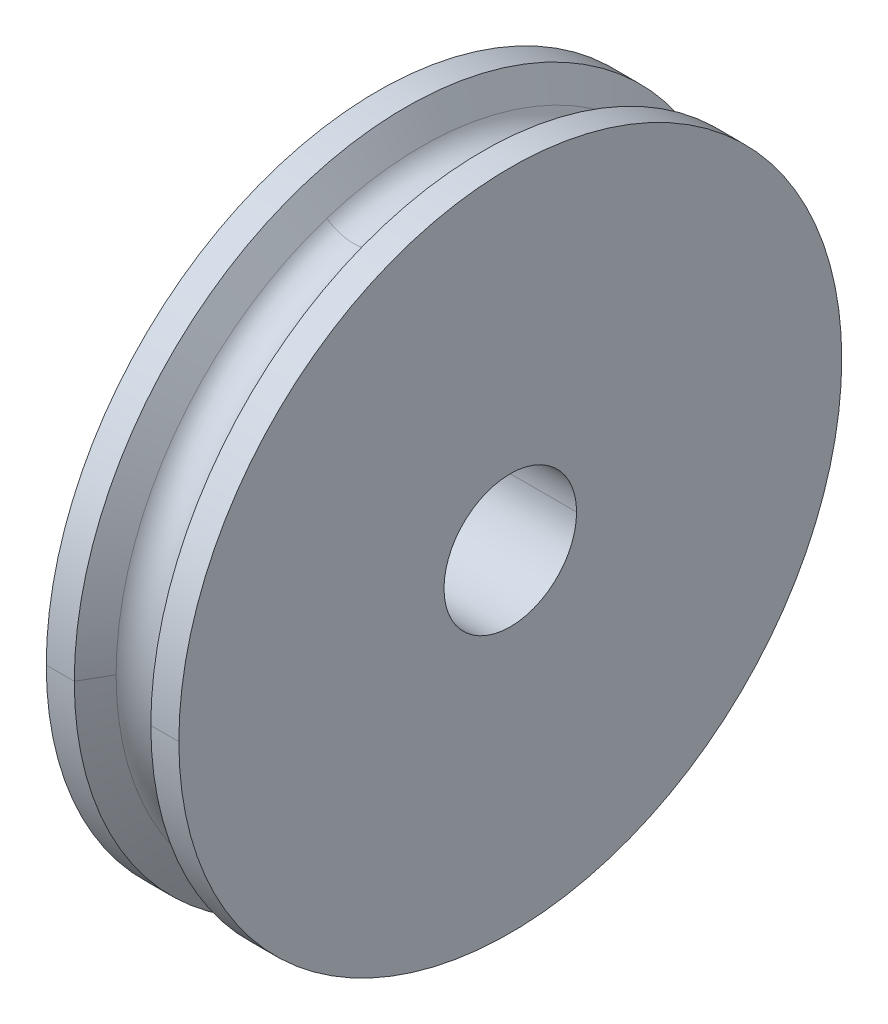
ISO-10303-21;
HEADER;
FILE_DESCRIPTION(('STEP AP214'),'2;1');
FILE_NAME('part.step','',(''),(''),'','','');
FILE_SCHEMA(('AUTOMOTIVE_DESIGN { 1 0 10303 214 1 1 1 1 }'));
ENDSEC;
DATA;
#1=APPLICATION_CONTEXT('core data for automotive mechanical design processes');
#2=APPLICATION_PROTOCOL_DEFINITION('international standard','automotive_design',2000,#1);
#3=PRODUCT_CONTEXT('',#1,'mechanical');
#4=PRODUCT('Part','Part','',(#3));
#5=PRODUCT_RELATED_PRODUCT_CATEGORY('part','',(#4));
#6=PRODUCT_DEFINITION_FORMATION('','',#4);
#7=PRODUCT_DEFINITION_CONTEXT('part definition',#1,'design');
#8=PRODUCT_DEFINITION('design','',#6,#7);
#9=PRODUCT_DEFINITION_SHAPE('','',#8);
#10=(LENGTH_UNIT() NAMED_UNIT(*) SI_UNIT(.MILLI.,.METRE.));
#11=(NAMED_UNIT(*) PLANE_ANGLE_UNIT() SI_UNIT($,.RADIAN.));
#12=(NAMED_UNIT(*) SI_UNIT($,.STERADIAN.) SOLID_ANGLE_UNIT());
#13=UNCERTAINTY_MEASURE_WITH_UNIT(LENGTH_MEASURE(1.E-05),#10,'distance_accuracy_value','');
#14=(GEOMETRIC_REPRESENTATION_CONTEXT(3) GLOBAL_UNCERTAINTY_ASSIGNED_CONTEXT((#13)) GLOBAL_UNIT_ASSIGNED_CONTEXT((#10,
#11,#12)) REPRESENTATION_CONTEXT('',''));
#15=CARTESIAN_POINT('',(0.,0.,0.));
#16=DIRECTION('',(0.,0.,1.));
#17=DIRECTION('',(1.,0.,0.));
#18=AXIS2_PLACEMENT_3D('',#15,#16,#17);
#19=CARTESIAN_POINT('',(-5.,25.,0.));
#20=DIRECTION('',(-1.,0.,0.));
#21=DIRECTION('',(0.,0.,1.));
#22=AXIS2_PLACEMENT_3D('',#19,#20,#21);
#23=PLANE('',#22);
#24=CARTESIAN_POINT('',(-5.,0.,0.));
#25=DIRECTION('',(1.,0.,0.));
#26=DIRECTION('',(0.,0.,-1.));
#27=AXIS2_PLACEMENT_3D('',#24,#25,#26);
#28=CIRCLE('',#27,5.);
#29=CARTESIAN_POINT('',(-5.,0.,-5.));
#30=VERTEX_POINT('',#29);
#31=CARTESIAN_POINT('',(-5.,0.,5.));
#32=VERTEX_POINT('',#31);
#33=EDGE_CURVE('E11',#30,#32,#28,.T.);
#34=ORIENTED_EDGE('',*,*,#33,.T.);
#35=CARTESIAN_POINT('',(-5.,0.,0.));
#36=DIRECTION('',(1.,0.,0.));
#37=DIRECTION('',(0.,0.,-1.));
#38=AXIS2_PLACEMENT_3D('',#35,#36,#37);
#39=CIRCLE('',#38,5.);
#40=EDGE_CURVE('E25',#32,#30,#39,.T.);
#41=ORIENTED_EDGE('',*,*,#40,.T.);
#42=EDGE_LOOP('',(#34,#41));
#43=FACE_BOUND('',#42,.T.);
#44=CARTESIAN_POINT('',(-5.,0.,0.));
#45=DIRECTION('',(1.,0.,0.));
#46=DIRECTION('',(0.,0.,-1.));
#47=AXIS2_PLACEMENT_3D('',#44,#45,#46);
#48=CIRCLE('',#47,25.);
#49=CARTESIAN_POINT('',(-5.,0.,25.));
#50=VERTEX_POINT('',#49);
#51=CARTESIAN_POINT('',(-5.,0.,-25.));
#52=VERTEX_POINT('',#51);
#53=EDGE_CURVE('E219',#50,#52,#48,.T.);
#54=ORIENTED_EDGE('',*,*,#53,.F.);
#55=CARTESIAN_POINT('',(-5.,0.,0.));
#56=DIRECTION('',(1.,0.,0.));
#57=DIRECTION('',(0.,0.,-1.));
#58=AXIS2_PLACEMENT_3D('',#55,#56,#57);
#59=CIRCLE('',#58,25.);
#60=EDGE_CURVE('E214',#52,#50,#59,.T.);
#61=ORIENTED_EDGE('',*,*,#60,.F.);
#62=EDGE_LOOP('',(#54,#61));
#63=FACE_BOUND('',#62,.T.);
#64=ADVANCED_FACE('F17',(#43,#63),#23,.T.);
#65=CARTESIAN_POINT('',(5.,0.,0.));
#66=DIRECTION('',(1.,0.,0.));
#67=DIRECTION('',(0.,-1.,-1.13303980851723E-13));
#68=AXIS2_PLACEMENT_3D('',#65,#66,#67);
#69=CYLINDRICAL_SURFACE('',#68,25.);
#70=DIRECTION('',(1.,0.,0.));
#71=VECTOR('',#70,1.);
#72=CARTESIAN_POINT('',(-5.,0.,25.));
#73=LINE('',#72,#71);
#74=CARTESIAN_POINT('',(-2.8867513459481,0.,25.));
#75=VERTEX_POINT('',#74);
#76=EDGE_CURVE('E210',#50,#75,#73,.T.);
#77=ORIENTED_EDGE('',*,*,#76,.T.);
#78=CARTESIAN_POINT('',(-2.8867513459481,0.,0.));
#79=DIRECTION('',(1.,0.,0.));
#80=DIRECTION('',(0.,0.,-1.));
#81=AXIS2_PLACEMENT_3D('',#78,#79,#80);
#82=CIRCLE('',#81,25.);
#83=CARTESIAN_POINT('',(-2.8867513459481,0.,-25.));
#84=VERTEX_POINT('',#83);
#85=EDGE_CURVE('E205',#84,#75,#82,.T.);
#86=ORIENTED_EDGE('',*,*,#85,.F.);
#87=DIRECTION('',(1.,0.,0.));
#88=VECTOR('',#87,1.);
#89=CARTESIAN_POINT('',(-5.,0.,-25.));
#90=LINE('',#89,#88);
#91=EDGE_CURVE('E200',#52,#84,#90,.T.);
#92=ORIENTED_EDGE('',*,*,#91,.F.);
#93=ORIENTED_EDGE('',*,*,#60,.T.);
#94=EDGE_LOOP('',(#77,#86,#92,#93));
#95=FACE_BOUND('',#94,.T.);
#96=ADVANCED_FACE('F235',(#95),#69,.T.);
#97=CARTESIAN_POINT('',(5.,0.,0.));
#98=DIRECTION('',(1.,0.,0.));
#99=DIRECTION('',(0.,1.,0.));
#100=AXIS2_PLACEMENT_3D('',#97,#98,#99);
#101=CYLINDRICAL_SURFACE('',#100,25.);
#102=ORIENTED_EDGE('',*,*,#76,.F.);
#103=ORIENTED_EDGE('',*,*,#53,.T.);
#104=ORIENTED_EDGE('',*,*,#91,.T.);
#105=CARTESIAN_POINT('',(-2.8867513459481,0.,0.));
#106=DIRECTION('',(1.,0.,0.));
#107=DIRECTION('',(0.,0.,-1.));
#108=AXIS2_PLACEMENT_3D('',#105,#106,#107);
#109=CIRCLE('',#108,25.);
#110=EDGE_CURVE('E195',#75,#84,#109,.T.);
#111=ORIENTED_EDGE('',*,*,#110,.F.);
#112=EDGE_LOOP('',(#102,#103,#104,#111));
#113=FACE_BOUND('',#112,.T.);
#114=ADVANCED_FACE('F230',(#113),#101,.T.);
#115=CARTESIAN_POINT('',(-1.7320508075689,0.,0.));
#116=DIRECTION('',(-1.,0.,0.));
#117=DIRECTION('',(0.,1.,0.));
#118=AXIS2_PLACEMENT_3D('',#115,#116,#117);
#119=CONICAL_SURFACE('',#118,23.,1.04719755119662);
#120=DIRECTION('',(-0.499999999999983,0.,-0.866025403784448));
#121=VECTOR('',#120,1.);
#122=CARTESIAN_POINT('',(-1.7320508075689,0.,-23.));
#123=LINE('',#122,#121);
#124=CARTESIAN_POINT('',(-1.7320508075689,0.,-23.));
#125=VERTEX_POINT('',#124);
#126=EDGE_CURVE('E190',#125,#84,#123,.T.);
#127=ORIENTED_EDGE('',*,*,#126,.F.);
#128=CARTESIAN_POINT('',(-1.7320508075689,0.,0.));
#129=DIRECTION('',(1.,0.,0.));
#130=DIRECTION('',(0.,0.,-1.));
#131=AXIS2_PLACEMENT_3D('',#128,#129,#130);
#132=CIRCLE('',#131,23.);
#133=CARTESIAN_POINT('',(-1.73205080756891,-21.8742998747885,-7.10739087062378));
#134=VERTEX_POINT('',#133);
#135=EDGE_CURVE('E185',#134,#125,#132,.T.);
#136=ORIENTED_EDGE('',*,*,#135,.F.);
#137=CARTESIAN_POINT('',(-1.7320508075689,0.,0.));
#138=DIRECTION('',(1.,0.,0.));
#139=DIRECTION('',(0.,0.,-1.));
#140=AXIS2_PLACEMENT_3D('',#137,#138,#139);
#141=CIRCLE('',#140,23.);
#142=CARTESIAN_POINT('',(-1.7320508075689,0.,23.));
#143=VERTEX_POINT('',#142);
#144=EDGE_CURVE('E180',#143,#134,#141,.T.);
#145=ORIENTED_EDGE('',*,*,#144,.F.);
#146=DIRECTION('',(-0.499999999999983,0.,0.866025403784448));
#147=VECTOR('',#146,1.);
#148=CARTESIAN_POINT('',(-1.7320508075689,0.,23.));
#149=LINE('',#148,#147);
#150=EDGE_CURVE('E175',#143,#75,#149,.T.);
#151=ORIENTED_EDGE('',*,*,#150,.T.);
#152=ORIENTED_EDGE('',*,*,#110,.T.);
#153=EDGE_LOOP('',(#127,#136,#145,#151,#152));
#154=FACE_BOUND('',#153,.T.);
#155=ADVANCED_FACE('F241',(#154),#119,.T.);
#156=CARTESIAN_POINT('',(-1.7320508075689,0.,0.));
#157=DIRECTION('',(-1.,0.,0.));
#158=DIRECTION('',(0.,-1.,0.));
#159=AXIS2_PLACEMENT_3D('',#156,#157,#158);
#160=CONICAL_SURFACE('',#159,23.,1.04719755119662);
#161=ORIENTED_EDGE('',*,*,#126,.T.);
#162=ORIENTED_EDGE('',*,*,#85,.T.);
#163=ORIENTED_EDGE('',*,*,#150,.F.);
#164=CARTESIAN_POINT('',(-1.7320508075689,0.,0.));
#165=DIRECTION('',(1.,0.,0.));
#166=DIRECTION('',(0.,0.,-1.));
#167=AXIS2_PLACEMENT_3D('',#164,#165,#166);
#168=CIRCLE('',#167,23.);
#169=CARTESIAN_POINT('',(-1.73205080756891,21.8742998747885,7.10739087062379));
#170=VERTEX_POINT('',#169);
#171=EDGE_CURVE('E170',#170,#143,#168,.T.);
#172=ORIENTED_EDGE('',*,*,#171,.F.);
#173=CARTESIAN_POINT('',(-1.7320508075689,0.,0.));
#174=DIRECTION('',(1.,0.,0.));
#175=DIRECTION('',(0.,0.,-1.));
#176=AXIS2_PLACEMENT_3D('',#173,#174,#175);
#177=CIRCLE('',#176,23.);
#178=EDGE_CURVE('E165',#125,#170,#177,.T.);
#179=ORIENTED_EDGE('',*,*,#178,.F.);
#180=EDGE_LOOP('',(#161,#162,#163,#172,#179));
#181=FACE_BOUND('',#180,.T.);
#182=ADVANCED_FACE('F238',(#181),#160,.T.);
#183=CARTESIAN_POINT('',(0.,0.,0.));
#184=DIRECTION('',(1.,0.,0.));
#185=DIRECTION('',(0.,-0.309016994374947,0.951056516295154));
#186=AXIS2_PLACEMENT_3D('',#183,#184,#185);
#187=TOROIDAL_SURFACE('',#186,24.,2.00000000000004);
#188=CARTESIAN_POINT('',(0.,-22.8253563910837,-7.41640786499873));
#189=DIRECTION('',(0.,0.309016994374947,-0.951056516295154));
#190=DIRECTION('',(-0.86602540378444,0.475528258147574,0.154508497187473));
#191=AXIS2_PLACEMENT_3D('',#188,#189,#190);
#192=CIRCLE('',#191,2.00000000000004);
#193=CARTESIAN_POINT('',(1.73205080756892,-21.8742998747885,-7.10739087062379));
#194=VERTEX_POINT('',#193);
#195=EDGE_CURVE('E160',#134,#194,#192,.T.);
#196=ORIENTED_EDGE('',*,*,#195,.F.);
#197=ORIENTED_EDGE('',*,*,#135,.T.);
#198=ORIENTED_EDGE('',*,*,#178,.T.);
#199=CARTESIAN_POINT('',(0.,22.8253563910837,7.41640786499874));
#200=DIRECTION('',(0.,-0.309016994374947,0.951056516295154));
#201=DIRECTION('',(-0.866025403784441,-0.475528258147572,-0.154508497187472));
#202=AXIS2_PLACEMENT_3D('',#199,#200,#201);
#203=CIRCLE('',#202,2.00000000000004);
#204=CARTESIAN_POINT('',(1.73205080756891,21.8742998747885,7.10739087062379));
#205=VERTEX_POINT('',#204);
#206=EDGE_CURVE('E156',#170,#205,#203,.T.);
#207=ORIENTED_EDGE('',*,*,#206,.T.);
#208=CARTESIAN_POINT('',(1.7320508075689,0.,0.));
#209=DIRECTION('',(1.,0.,0.));
#210=DIRECTION('',(0.,0.,-1.));
#211=AXIS2_PLACEMENT_3D('',#208,#209,#210);
#212=CIRCLE('',#211,23.);
#213=CARTESIAN_POINT('',(1.7320508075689,0.,-23.));
#214=VERTEX_POINT('',#213);
#215=EDGE_CURVE('E151',#214,#205,#212,.T.);
#216=ORIENTED_EDGE('',*,*,#215,.F.);
#217=CARTESIAN_POINT('',(1.7320508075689,0.,0.));
#218=DIRECTION('',(1.,0.,0.));
#219=DIRECTION('',(0.,0.,-1.));
#220=AXIS2_PLACEMENT_3D('',#217,#218,#219);
#221=CIRCLE('',#220,23.);
#222=EDGE_CURVE('E146',#194,#214,#221,.T.);
#223=ORIENTED_EDGE('',*,*,#222,.F.);
#224=EDGE_LOOP('',(#196,#197,#198,#207,#216,#223));
#225=FACE_BOUND('',#224,.T.);
#226=ADVANCED_FACE('F251',(#225),#187,.F.);
#227=CARTESIAN_POINT('',(2.8867513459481,0.,0.));
#228=DIRECTION('',(1.,0.,0.));
#229=DIRECTION('',(0.,1.,0.));
#230=AXIS2_PLACEMENT_3D('',#227,#228,#229);
#231=CONICAL_SURFACE('',#230,25.,1.04719755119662);
#232=DIRECTION('',(0.499999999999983,0.,0.866025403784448));
#233=VECTOR('',#232,1.);
#234=CARTESIAN_POINT('',(1.7320508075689,0.,23.));
#235=LINE('',#234,#233);
#236=CARTESIAN_POINT('',(1.7320508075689,0.,23.));
#237=VERTEX_POINT('',#236);
#238=CARTESIAN_POINT('',(2.8867513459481,0.,25.));
#239=VERTEX_POINT('',#238);
#240=EDGE_CURVE('E141',#237,#239,#235,.T.);
#241=ORIENTED_EDGE('',*,*,#240,.F.);
#242=CARTESIAN_POINT('',(1.7320508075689,0.,0.));
#243=DIRECTION('',(1.,0.,0.));
#244=DIRECTION('',(0.,0.,-1.));
#245=AXIS2_PLACEMENT_3D('',#242,#243,#244);
#246=CIRCLE('',#245,23.);
#247=EDGE_CURVE('E136',#237,#194,#246,.T.);
#248=ORIENTED_EDGE('',*,*,#247,.T.);
#249=ORIENTED_EDGE('',*,*,#222,.T.);
#250=DIRECTION('',(0.499999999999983,0.,-0.866025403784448));
#251=VECTOR('',#250,1.);
#252=CARTESIAN_POINT('',(1.7320508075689,0.,-23.));
#253=LINE('',#252,#251);
#254=CARTESIAN_POINT('',(2.8867513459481,0.,-25.));
#255=VERTEX_POINT('',#254);
#256=EDGE_CURVE('E132',#214,#255,#253,.T.);
#257=ORIENTED_EDGE('',*,*,#256,.T.);
#258=CARTESIAN_POINT('',(2.8867513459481,0.,0.));
#259=DIRECTION('',(1.,0.,0.));
#260=DIRECTION('',(0.,0.,-1.));
#261=AXIS2_PLACEMENT_3D('',#258,#259,#260);
#262=CIRCLE('',#261,25.);
#263=EDGE_CURVE('E127',#239,#255,#262,.T.);
#264=ORIENTED_EDGE('',*,*,#263,.F.);
#265=EDGE_LOOP('',(#241,#248,#249,#257,#264));
#266=FACE_BOUND('',#265,.T.);
#267=ADVANCED_FACE('F253',(#266),#231,.T.);
#268=CARTESIAN_POINT('',(5.,0.,0.));
#269=DIRECTION('',(1.,0.,0.));
#270=DIRECTION('',(0.,1.,0.));
#271=AXIS2_PLACEMENT_3D('',#268,#269,#270);
#272=CYLINDRICAL_SURFACE('',#271,25.);
#273=DIRECTION('',(1.,0.,0.));
#274=VECTOR('',#273,1.);
#275=CARTESIAN_POINT('',(2.8867513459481,0.,25.));
#276=LINE('',#275,#274);
#277=CARTESIAN_POINT('',(5.,0.,25.));
#278=VERTEX_POINT('',#277);
#279=EDGE_CURVE('E122',#239,#278,#276,.T.);
#280=ORIENTED_EDGE('',*,*,#279,.F.);
#281=ORIENTED_EDGE('',*,*,#263,.T.);
#282=DIRECTION('',(1.,0.,0.));
#283=VECTOR('',#282,1.);
#284=CARTESIAN_POINT('',(2.8867513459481,0.,-25.));
#285=LINE('',#284,#283);
#286=CARTESIAN_POINT('',(5.,0.,-25.));
#287=VERTEX_POINT('',#286);
#288=EDGE_CURVE('E118',#255,#287,#285,.T.);
#289=ORIENTED_EDGE('',*,*,#288,.T.);
#290=CARTESIAN_POINT('',(5.,0.,0.));
#291=DIRECTION('',(1.,0.,0.));
#292=DIRECTION('',(0.,0.,-1.));
#293=AXIS2_PLACEMENT_3D('',#290,#291,#292);
#294=CIRCLE('',#293,25.);
#295=EDGE_CURVE('E107',#278,#287,#294,.T.);
#296=ORIENTED_EDGE('',*,*,#295,.F.);
#297=EDGE_LOOP('',(#280,#281,#289,#296));
#298=FACE_BOUND('',#297,.T.);
#299=ADVANCED_FACE('F276',(#298),#272,.T.);
#300=CARTESIAN_POINT('',(5.,5.,0.));
#301=DIRECTION('',(1.,0.,0.));
#302=DIRECTION('',(0.,0.,-1.));
#303=AXIS2_PLACEMENT_3D('',#300,#301,#302);
#304=PLANE('',#303);
#305=CARTESIAN_POINT('',(5.,0.,0.));
#306=DIRECTION('',(1.,0.,0.));
#307=DIRECTION('',(0.,0.,-1.));
#308=AXIS2_PLACEMENT_3D('',#305,#306,#307);
#309=CIRCLE('',#308,25.);
#310=EDGE_CURVE('E104',#287,#278,#309,.T.);
#311=ORIENTED_EDGE('',*,*,#310,.T.);
#312=ORIENTED_EDGE('',*,*,#295,.T.);
#313=EDGE_LOOP('',(#311,#312));
#314=FACE_BOUND('',#313,.T.);
#315=CARTESIAN_POINT('',(5.,0.,0.));
#316=DIRECTION('',(1.,0.,0.));
#317=DIRECTION('',(0.,0.,-1.));
#318=AXIS2_PLACEMENT_3D('',#315,#316,#317);
#319=CIRCLE('',#318,5.);
#320=CARTESIAN_POINT('',(5.,0.,5.));
#321=VERTEX_POINT('',#320);
#322=CARTESIAN_POINT('',(5.,0.,-5.));
#323=VERTEX_POINT('',#322);
#324=EDGE_CURVE('E91',#321,#323,#319,.T.);
#325=ORIENTED_EDGE('',*,*,#324,.F.);
#326=CARTESIAN_POINT('',(5.,0.,0.));
#327=DIRECTION('',(1.,0.,0.));
#328=DIRECTION('',(0.,0.,-1.));
#329=AXIS2_PLACEMENT_3D('',#326,#327,#328);
#330=CIRCLE('',#329,5.);
#331=EDGE_CURVE('E87',#323,#321,#330,.T.);
#332=ORIENTED_EDGE('',*,*,#331,.F.);
#333=EDGE_LOOP('',(#325,#332));
#334=FACE_BOUND('',#333,.T.);
#335=ADVANCED_FACE('F89',(#314,#334),#304,.T.);
#336=CARTESIAN_POINT('',(5.,0.,0.));
#337=DIRECTION('',(1.,0.,0.));
#338=DIRECTION('',(0.,-1.,0.));
#339=AXIS2_PLACEMENT_3D('',#336,#337,#338);
#340=CYLINDRICAL_SURFACE('',#339,5.);
#341=DIRECTION('',(1.,0.,0.));
#342=VECTOR('',#341,1.);
#343=CARTESIAN_POINT('',(-5.,0.,5.));
#344=LINE('',#343,#342);
#345=EDGE_CURVE('E95',#32,#321,#344,.T.);
#346=ORIENTED_EDGE('',*,*,#345,.F.);
#347=ORIENTED_EDGE('',*,*,#33,.F.);
#348=DIRECTION('',(1.,0.,0.));
#349=VECTOR('',#348,1.);
#350=CARTESIAN_POINT('',(-5.,0.,-5.));
#351=LINE('',#350,#349);
#352=EDGE_CURVE('E98',#30,#323,#351,.T.);
#353=ORIENTED_EDGE('',*,*,#352,.T.);
#354=ORIENTED_EDGE('',*,*,#331,.T.);
#355=EDGE_LOOP('',(#346,#347,#353,#354));
#356=FACE_BOUND('',#355,.T.);
#357=ADVANCED_FACE('F99',(#356),#340,.F.);
#358=CARTESIAN_POINT('',(5.,0.,0.));
#359=DIRECTION('',(1.,0.,0.));
#360=DIRECTION('',(0.,1.,0.));
#361=AXIS2_PLACEMENT_3D('',#358,#359,#360);
#362=CYLINDRICAL_SURFACE('',#361,5.);
#363=ORIENTED_EDGE('',*,*,#345,.T.);
#364=ORIENTED_EDGE('',*,*,#324,.T.);
#365=ORIENTED_EDGE('',*,*,#352,.F.);
#366=ORIENTED_EDGE('',*,*,#40,.F.);
#367=EDGE_LOOP('',(#363,#364,#365,#366));
#368=FACE_BOUND('',#367,.T.);
#369=ADVANCED_FACE('F103',(#368),#362,.F.);
#370=CARTESIAN_POINT('',(5.,0.,0.));
#371=DIRECTION('',(1.,0.,0.));
#372=DIRECTION('',(0.,-1.,0.));
#373=AXIS2_PLACEMENT_3D('',#370,#371,#372);
#374=CYLINDRICAL_SURFACE('',#373,25.);
#375=ORIENTED_EDGE('',*,*,#279,.T.);
#376=ORIENTED_EDGE('',*,*,#310,.F.);
#377=ORIENTED_EDGE('',*,*,#288,.F.);
#378=CARTESIAN_POINT('',(2.8867513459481,0.,0.));
#379=DIRECTION('',(1.,0.,0.));
#380=DIRECTION('',(0.,0.,-1.));
#381=AXIS2_PLACEMENT_3D('',#378,#379,#380);
#382=CIRCLE('',#381,25.);
#383=EDGE_CURVE('E101',#255,#239,#382,.T.);
#384=ORIENTED_EDGE('',*,*,#383,.T.);
#385=EDGE_LOOP('',(#375,#376,#377,#384));
#386=FACE_BOUND('',#385,.T.);
#387=ADVANCED_FACE('F273',(#386),#374,.T.);
#388=CARTESIAN_POINT('',(2.8867513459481,0.,0.));
#389=DIRECTION('',(1.,0.,0.));
#390=DIRECTION('',(0.,-1.,0.));
#391=AXIS2_PLACEMENT_3D('',#388,#389,#390);
#392=CONICAL_SURFACE('',#391,25.,1.04719755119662);
#393=ORIENTED_EDGE('',*,*,#240,.T.);
#394=ORIENTED_EDGE('',*,*,#383,.F.);
#395=ORIENTED_EDGE('',*,*,#256,.F.);
#396=ORIENTED_EDGE('',*,*,#215,.T.);
#397=CARTESIAN_POINT('',(1.7320508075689,0.,0.));
#398=DIRECTION('',(1.,0.,0.));
#399=DIRECTION('',(0.,0.,-1.));
#400=AXIS2_PLACEMENT_3D('',#397,#398,#399);
#401=CIRCLE('',#400,23.);
#402=EDGE_CURVE('E249',#205,#237,#401,.T.);
#403=ORIENTED_EDGE('',*,*,#402,.T.);
#404=EDGE_LOOP('',(#393,#394,#395,#396,#403));
#405=FACE_BOUND('',#404,.T.);
#406=ADVANCED_FACE('F257',(#405),#392,.T.);
#407=CARTESIAN_POINT('',(0.,0.,0.));
#408=DIRECTION('',(1.,0.,0.));
#409=DIRECTION('',(0.,0.309016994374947,-0.951056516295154));
#410=AXIS2_PLACEMENT_3D('',#407,#408,#409);
#411=TOROIDAL_SURFACE('',#410,24.,2.00000000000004);
#412=ORIENTED_EDGE('',*,*,#195,.T.);
#413=ORIENTED_EDGE('',*,*,#247,.F.);
#414=ORIENTED_EDGE('',*,*,#402,.F.);
#415=ORIENTED_EDGE('',*,*,#206,.F.);
#416=ORIENTED_EDGE('',*,*,#171,.T.);
#417=ORIENTED_EDGE('',*,*,#144,.T.);
#418=EDGE_LOOP('',(#412,#413,#414,#415,#416,#417));
#419=FACE_BOUND('',#418,.T.);
#420=ADVANCED_FACE('F245',(#419),#411,.F.);
#421=CLOSED_SHELL('',(#64,#96,#114,#155,#182,#226,#267,#299,#335,#357,#369,#387,#406,#420));
#422=MANIFOLD_SOLID_BREP('B1',#421);
#423=ADVANCED_BREP_SHAPE_REPRESENTATION('',(#18,#422),#14);
#424=SHAPE_DEFINITION_REPRESENTATION(#9,#423);
ENDSEC;
END-ISO-10303-21;
